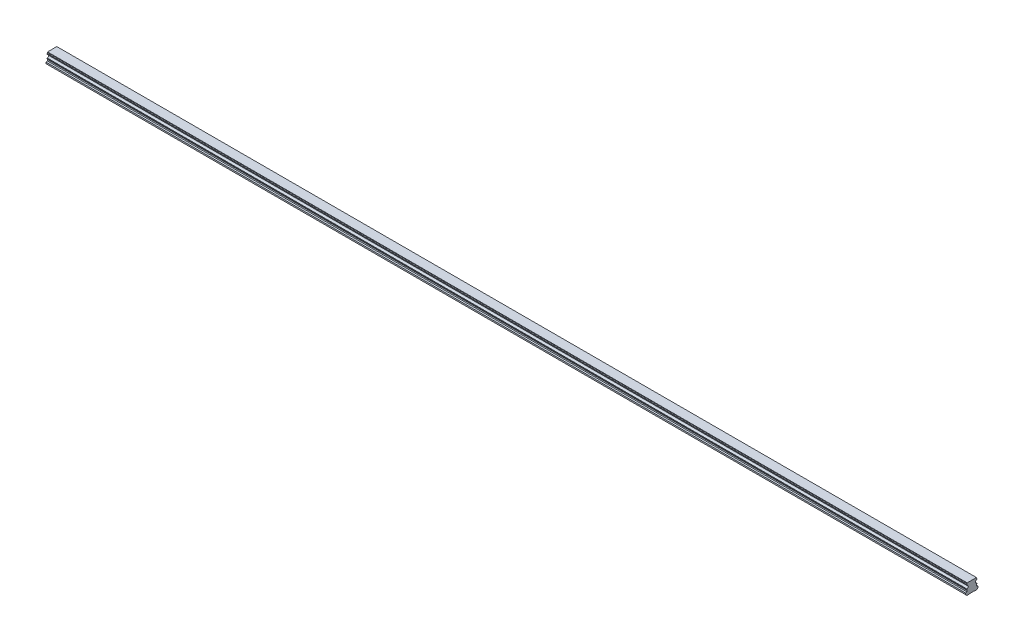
from build123d import *

# Parameters (mm, degrees)
BOSS_EXTRUDE1_DEPTH        = 1860
SKETCH3_R                  = 3
SKETCH3_R_2                = 2.5
CUT_EXTRUDE3_DEPTH         = 12
SKETCH3_2_R                = 2.5
CUT_EXTRUDE4_DEPTH         = 15
CHAMFER1_SIZE              = 0.5
LPATTERN4_COUNT            = 31
LPATTERN4_PITCH            = 60
CHAMFER1_OF_LPATTERN4_SIZE = 0.5


with BuildPart() as part:
    # Sketch1 → Boss-Extrude1 (new body)
    with BuildSketch(Plane(origin=(0, 0, 0), x_dir=(0, 0, -1), z_dir=(1, 0, 0))):
        with BuildLine():
            Line((9.375, 21.8), (-9.375, 21.8))
            Line((-9.375, 21.8), (-9.375, 20.756))
            Line((-9.375, 20.756), (-10, 19.415683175))
            Line((-10, 19.415683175), (-10, 17.685449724))
            ThreePointArc((-10, 17.685449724), (-7.2, 14.6), (-10, 11.514550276))
            Line((-10, 11.514550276), (-10, 9.784316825))
            Line((-10, 9.784316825), (-9.375, 8.444))
            Line((-9.375, 8.444), (-9.922688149, 6.4))
            Line((-9.922688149, 6.4), (-12.5, 5.489338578))
            Line((-12.5, 5.489338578), (-12.5, 2.65))
            Line((-12.5, 2.65), (-9.85, 0))
            Line((-9.85, 0), (-5.5, 0))
            Line((-5.5, 0), (-5, 0.5))
            Line((-5, 0.5), (5, 0.5))
            Line((5, 0.5), (5.5, 0))
            Line((5.5, 0), (9.85, 0))
            Line((9.85, 0), (12.5, 2.65))
            Line((12.5, 2.65), (12.5, 5.489338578))
            Line((12.5, 5.489338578), (9.922688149, 6.4))
            Line((9.922688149, 6.4), (9.375, 8.444))
            Line((9.375, 8.444), (10, 9.784316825))
            Line((10, 9.784316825), (10, 11.514550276))
            ThreePointArc((10, 11.514550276), (7.2, 14.6), (10, 17.685449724))
            Line((10, 17.685449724), (10, 19.415683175))
            Line((10, 19.415683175), (9.375, 20.756))
            Line((9.375, 20.756), (9.375, 21.8))
        make_face()
    extrude(amount=BOSS_EXTRUDE1_DEPTH)

    # Sketch3 → Cut-Extrude3 (cut)
    with BuildSketch(Plane.XZ):
        with Locations(Location((30, 0, 0), (0, 0, 270))):
            Circle(SKETCH3_R)
        with Locations(Location((30, 0, 0), (0, 0, 270))):
            Circle(SKETCH3_R_2, mode=Mode.SUBTRACT)
    cut_extrude3 = extrude(amount=-CUT_EXTRUDE3_DEPTH, mode=Mode.SUBTRACT)

    # Sketch3_2 → Cut-Extrude4 (cut)
    with BuildSketch(Plane.XZ):
        with Locations(Location((30, 0, 0), (0, 0, 270))):
            Circle(SKETCH3_2_R)
    cut_extrude4 = extrude(amount=-CUT_EXTRUDE4_DEPTH, mode=Mode.SUBTRACT)

    # Cut-Extrude5 cone 1 section (on through the dimple's axis) → Cut-Extrude5 (revolve, cut)
    with BuildSketch(Plane(origin=(30, 15, 0), x_dir=(0, 0, -1), z_dir=(1, 0, 0))):
        Polygon((0, 0), (2.5, 0), (0, 1.443375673), align=None)
    cut_extrude5 = revolve(axis=Axis((30, 15, 0), (0, 1, 0)), mode=Mode.SUBTRACT)

    # Chamfer1
    chamfer1_edges = [part.edges().sort_by_distance(p)[0] for p in [
        (30, 0.5, 3),
    ]]
    chamfer(chamfer1_edges, length=CHAMFER1_SIZE)

    # LPattern4: Cut-Extrude3, Cut-Extrude4, Cut-Extrude5 ×31
    with Locations(*[(i * LPATTERN4_PITCH, 0, 0) for i in range(1, LPATTERN4_COUNT)]):
        add(cut_extrude3, mode=Mode.SUBTRACT)
        add(cut_extrude4, mode=Mode.SUBTRACT)
        add(cut_extrude5, mode=Mode.SUBTRACT)

    # Chamfer1 of LPattern4
    chamfer1_of_lpattern4_edges = [part.edges().sort_by_distance(p)[0] for p in [
        (90, 0.5, 3),
        (150, 0.5, 3),
        (210, 0.5, 3),
        (270, 0.5, 3),
        (330, 0.5, 3),
        (390, 0.5, 3),
        (450, 0.5, 3),
        (510, 0.5, 3),
        (570, 0.5, 3),
        (630, 0.5, 3),
        (690, 0.5, 3),
        (750, 0.5, 3),
        (810, 0.5, 3),
        (870, 0.5, 3),
        (930, 0.5, 3),
        (990, 0.5, 3),
        (1050, 0.5, 3),
        (1110, 0.5, 3),
        (1170, 0.5, 3),
        (1230, 0.5, 3),
        (1290, 0.5, 3),
        (1350, 0.5, 3),
        (1410, 0.5, 3),
        (1470, 0.5, 3),
        (1530, 0.5, 3),
        (1590, 0.5, 3),
        (1650, 0.5, 3),
        (1710, 0.5, 3),
        (1770, 0.5, 3),
        (1830, 0.5, 3),
    ]]
    chamfer(chamfer1_of_lpattern4_edges, length=CHAMFER1_OF_LPATTERN4_SIZE)


solid = part.part
